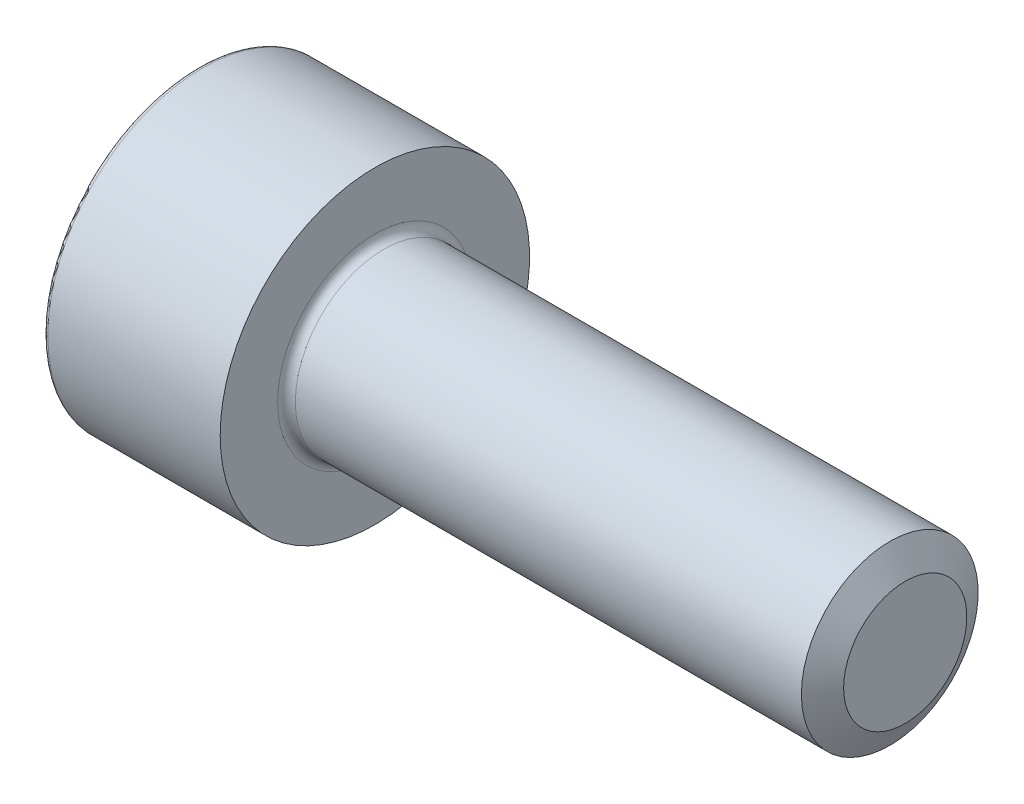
ISO-10303-21;
HEADER;
FILE_DESCRIPTION(('STEP AP214'),'2;1');
FILE_NAME('part.step','',(''),(''),'','','');
FILE_SCHEMA(('AUTOMOTIVE_DESIGN { 1 0 10303 214 1 1 1 1 }'));
ENDSEC;
DATA;
#1=APPLICATION_CONTEXT('core data for automotive mechanical design processes');
#2=APPLICATION_PROTOCOL_DEFINITION('international standard','automotive_design',2000,#1);
#3=PRODUCT_CONTEXT('',#1,'mechanical');
#4=PRODUCT('Part','Part','',(#3));
#5=PRODUCT_RELATED_PRODUCT_CATEGORY('part','',(#4));
#6=PRODUCT_DEFINITION_FORMATION('','',#4);
#7=PRODUCT_DEFINITION_CONTEXT('part definition',#1,'design');
#8=PRODUCT_DEFINITION('design','',#6,#7);
#9=PRODUCT_DEFINITION_SHAPE('','',#8);
#10=(LENGTH_UNIT() NAMED_UNIT(*) SI_UNIT(.MILLI.,.METRE.));
#11=(NAMED_UNIT(*) PLANE_ANGLE_UNIT() SI_UNIT($,.RADIAN.));
#12=(NAMED_UNIT(*) SI_UNIT($,.STERADIAN.) SOLID_ANGLE_UNIT());
#13=UNCERTAINTY_MEASURE_WITH_UNIT(LENGTH_MEASURE(1.E-05),#10,'distance_accuracy_value','');
#14=(GEOMETRIC_REPRESENTATION_CONTEXT(3) GLOBAL_UNCERTAINTY_ASSIGNED_CONTEXT((#13)) GLOBAL_UNIT_ASSIGNED_CONTEXT((#10,
#11,#12)) REPRESENTATION_CONTEXT('',''));
#15=CARTESIAN_POINT('',(0.,0.,0.));
#16=DIRECTION('',(0.,0.,1.));
#17=DIRECTION('',(1.,0.,0.));
#18=AXIS2_PLACEMENT_3D('',#15,#16,#17);
#19=CARTESIAN_POINT('',(0.,0.,0.));
#20=DIRECTION('',(-1.,0.,0.));
#21=DIRECTION('',(0.,0.,1.));
#22=AXIS2_PLACEMENT_3D('',#19,#20,#21);
#23=CYLINDRICAL_SURFACE('',#22,2.);
#24=CARTESIAN_POINT('',(4.2,0.,0.));
#25=DIRECTION('',(-1.,0.,0.));
#26=DIRECTION('',(0.,0.,1.));
#27=AXIS2_PLACEMENT_3D('',#24,#25,#26);
#28=CIRCLE('',#27,2.);
#29=CARTESIAN_POINT('',(4.2,0.,2.));
#30=VERTEX_POINT('',#29);
#31=EDGE_CURVE('E141',#30,#30,#28,.T.);
#32=ORIENTED_EDGE('',*,*,#31,.F.);
#33=EDGE_LOOP('',(#32));
#34=FACE_BOUND('',#33,.T.);
#35=CARTESIAN_POINT('',(15.6500102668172,0.,0.));
#36=DIRECTION('',(-1.,0.,0.));
#37=DIRECTION('',(0.,0.,1.));
#38=AXIS2_PLACEMENT_3D('',#35,#36,#37);
#39=CIRCLE('',#38,2.);
#40=CARTESIAN_POINT('',(15.6500102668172,0.,2.));
#41=VERTEX_POINT('',#40);
#42=EDGE_CURVE('E278',#41,#41,#39,.T.);
#43=ORIENTED_EDGE('',*,*,#42,.T.);
#44=EDGE_LOOP('',(#43));
#45=FACE_BOUND('',#44,.T.);
#46=ADVANCED_FACE('F38',(#34,#45),#23,.T.);
#47=CARTESIAN_POINT('',(0.,0.,0.));
#48=DIRECTION('',(1.,0.,0.));
#49=DIRECTION('',(0.,0.,-1.));
#50=AXIS2_PLACEMENT_3D('',#47,#48,#49);
#51=PLANE('',#50);
#52=CARTESIAN_POINT('',(0.,0.,0.));
#53=DIRECTION('',(1.,0.,0.));
#54=DIRECTION('',(0.,0.,-1.));
#55=AXIS2_PLACEMENT_3D('',#52,#53,#54);
#56=CIRCLE('',#55,3.4);
#57=CARTESIAN_POINT('',(0.,0.,-3.4));
#58=VERTEX_POINT('',#57);
#59=EDGE_CURVE('E46',#58,#58,#56,.F.);
#60=ORIENTED_EDGE('',*,*,#59,.T.);
#61=EDGE_LOOP('',(#60));
#62=FACE_BOUND('',#61,.T.);
#63=DIRECTION('',(0.,0.866025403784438,-0.5));
#64=VECTOR('',#63,1.);
#65=CARTESIAN_POINT('',(0.,0.,1.72));
#66=LINE('',#65,#64);
#67=CARTESIAN_POINT('',(0.,0.,1.72));
#68=VERTEX_POINT('',#67);
#69=CARTESIAN_POINT('',(0.,1.48956369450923,0.859999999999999));
#70=VERTEX_POINT('',#69);
#71=EDGE_CURVE('E127',#68,#70,#66,.T.);
#72=ORIENTED_EDGE('',*,*,#71,.F.);
#73=DIRECTION('',(0.,0.866025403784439,0.5));
#74=VECTOR('',#73,1.);
#75=CARTESIAN_POINT('',(0.,-1.48956369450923,0.86));
#76=LINE('',#75,#74);
#77=CARTESIAN_POINT('',(0.,-1.48956369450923,0.86));
#78=VERTEX_POINT('',#77);
#79=EDGE_CURVE('E53',#78,#68,#76,.T.);
#80=ORIENTED_EDGE('',*,*,#79,.F.);
#81=DIRECTION('',(0.,0.,1.));
#82=VECTOR('',#81,1.);
#83=CARTESIAN_POINT('',(0.,-1.48956369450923,-0.86));
#84=LINE('',#83,#82);
#85=CARTESIAN_POINT('',(0.,-1.48956369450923,-0.86));
#86=VERTEX_POINT('',#85);
#87=EDGE_CURVE('E137',#86,#78,#84,.T.);
#88=ORIENTED_EDGE('',*,*,#87,.F.);
#89=DIRECTION('',(0.,-0.866025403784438,0.5));
#90=VECTOR('',#89,1.);
#91=CARTESIAN_POINT('',(0.,0.,-1.72));
#92=LINE('',#91,#90);
#93=CARTESIAN_POINT('',(0.,0.,-1.72));
#94=VERTEX_POINT('',#93);
#95=EDGE_CURVE('E135',#94,#86,#92,.T.);
#96=ORIENTED_EDGE('',*,*,#95,.F.);
#97=DIRECTION('',(0.,-0.866025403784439,-0.5));
#98=VECTOR('',#97,1.);
#99=CARTESIAN_POINT('',(0.,1.48956369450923,-0.86));
#100=LINE('',#99,#98);
#101=CARTESIAN_POINT('',(0.,1.48956369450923,-0.86));
#102=VERTEX_POINT('',#101);
#103=EDGE_CURVE('E101',#102,#94,#100,.T.);
#104=ORIENTED_EDGE('',*,*,#103,.F.);
#105=DIRECTION('',(0.,0.,-1.));
#106=VECTOR('',#105,1.);
#107=CARTESIAN_POINT('',(0.,1.48956369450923,0.859999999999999));
#108=LINE('',#107,#106);
#109=EDGE_CURVE('E131',#70,#102,#108,.T.);
#110=ORIENTED_EDGE('',*,*,#109,.F.);
#111=EDGE_LOOP('',(#72,#80,#88,#96,#104,#110));
#112=FACE_BOUND('',#111,.T.);
#113=ADVANCED_FACE('F158',(#62,#112),#51,.F.);
#114=CARTESIAN_POINT('',(0.,0.,0.));
#115=DIRECTION('',(-1.,0.,0.));
#116=DIRECTION('',(0.,0.,1.));
#117=AXIS2_PLACEMENT_3D('',#114,#115,#116);
#118=CYLINDRICAL_SURFACE('',#117,3.5);
#119=CARTESIAN_POINT('',(0.1,0.,0.));
#120=DIRECTION('',(1.,0.,0.));
#121=DIRECTION('',(0.,0.,-1.));
#122=AXIS2_PLACEMENT_3D('',#119,#120,#121);
#123=CIRCLE('',#122,3.5);
#124=CARTESIAN_POINT('',(0.1,0.,-3.5));
#125=VERTEX_POINT('',#124);
#126=EDGE_CURVE('E11',#125,#125,#123,.T.);
#127=ORIENTED_EDGE('',*,*,#126,.T.);
#128=EDGE_LOOP('',(#127));
#129=FACE_BOUND('',#128,.T.);
#130=CARTESIAN_POINT('',(4.,0.,0.));
#131=DIRECTION('',(-1.,0.,0.));
#132=DIRECTION('',(0.,0.,1.));
#133=AXIS2_PLACEMENT_3D('',#130,#131,#132);
#134=CIRCLE('',#133,3.5);
#135=CARTESIAN_POINT('',(4.,0.,3.5));
#136=VERTEX_POINT('',#135);
#137=EDGE_CURVE('E152',#136,#136,#134,.T.);
#138=ORIENTED_EDGE('',*,*,#137,.T.);
#139=EDGE_LOOP('',(#138));
#140=FACE_BOUND('',#139,.T.);
#141=ADVANCED_FACE('F177',(#129,#140),#118,.T.);
#142=CARTESIAN_POINT('',(4.,3.5,0.));
#143=DIRECTION('',(-1.,0.,0.));
#144=DIRECTION('',(0.,0.,1.));
#145=AXIS2_PLACEMENT_3D('',#142,#143,#144);
#146=PLANE('',#145);
#147=ORIENTED_EDGE('',*,*,#137,.F.);
#148=EDGE_LOOP('',(#147));
#149=FACE_BOUND('',#148,.T.);
#150=CARTESIAN_POINT('',(4.,0.,0.));
#151=DIRECTION('',(-1.,0.,0.));
#152=DIRECTION('',(0.,0.,1.));
#153=AXIS2_PLACEMENT_3D('',#150,#151,#152);
#154=CIRCLE('',#153,2.2);
#155=CARTESIAN_POINT('',(4.,0.,2.2));
#156=VERTEX_POINT('',#155);
#157=EDGE_CURVE('E149',#156,#156,#154,.T.);
#158=ORIENTED_EDGE('',*,*,#157,.T.);
#159=EDGE_LOOP('',(#158));
#160=FACE_BOUND('',#159,.T.);
#161=ADVANCED_FACE('F186',(#149,#160),#146,.F.);
#162=CARTESIAN_POINT('',(4.2,0.,0.));
#163=DIRECTION('',(-1.,0.,0.));
#164=DIRECTION('',(0.,0.,1.));
#165=AXIS2_PLACEMENT_3D('',#162,#163,#164);
#166=TOROIDAL_SURFACE('',#165,2.2,0.2);
#167=ORIENTED_EDGE('',*,*,#157,.F.);
#168=EDGE_LOOP('',(#167));
#169=FACE_BOUND('',#168,.T.);
#170=ORIENTED_EDGE('',*,*,#31,.T.);
#171=EDGE_LOOP('',(#170));
#172=FACE_BOUND('',#171,.T.);
#173=ADVANCED_FACE('F182',(#169,#172),#166,.F.);
#174=CARTESIAN_POINT('',(2.,-1.48956369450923,0.86));
#175=DIRECTION('',(0.,-0.5,0.866025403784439));
#176=DIRECTION('',(0.,-0.866025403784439,-0.5));
#177=AXIS2_PLACEMENT_3D('',#174,#175,#176);
#178=PLANE('',#177);
#179=ORIENTED_EDGE('',*,*,#79,.T.);
#180=DIRECTION('',(-1.,0.,0.));
#181=VECTOR('',#180,1.);
#182=CARTESIAN_POINT('',(2.,0.,1.72));
#183=LINE('',#182,#181);
#184=CARTESIAN_POINT('',(2.,0.,1.72));
#185=VERTEX_POINT('',#184);
#186=EDGE_CURVE('E83',#185,#68,#183,.T.);
#187=ORIENTED_EDGE('',*,*,#186,.F.);
#188=DIRECTION('',(0.,0.866025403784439,0.5));
#189=VECTOR('',#188,1.);
#190=CARTESIAN_POINT('',(2.,-1.48956369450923,0.86));
#191=LINE('',#190,#189);
#192=CARTESIAN_POINT('',(2.,-1.48956369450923,0.86));
#193=VERTEX_POINT('',#192);
#194=EDGE_CURVE('E139',#193,#185,#191,.T.);
#195=ORIENTED_EDGE('',*,*,#194,.F.);
#196=DIRECTION('',(-1.,0.,0.));
#197=VECTOR('',#196,1.);
#198=CARTESIAN_POINT('',(2.,-1.48956369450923,0.86));
#199=LINE('',#198,#197);
#200=EDGE_CURVE('E61',#193,#78,#199,.T.);
#201=ORIENTED_EDGE('',*,*,#200,.T.);
#202=EDGE_LOOP('',(#179,#187,#195,#201));
#203=FACE_BOUND('',#202,.T.);
#204=ADVANCED_FACE('F185',(#203),#178,.F.);
#205=CARTESIAN_POINT('',(2.,-1.48956369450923,-0.86));
#206=DIRECTION('',(0.,-1.,0.));
#207=DIRECTION('',(0.,0.,-1.));
#208=AXIS2_PLACEMENT_3D('',#205,#206,#207);
#209=PLANE('',#208);
#210=ORIENTED_EDGE('',*,*,#87,.T.);
#211=ORIENTED_EDGE('',*,*,#200,.F.);
#212=DIRECTION('',(0.,0.,1.));
#213=VECTOR('',#212,1.);
#214=CARTESIAN_POINT('',(2.,-1.48956369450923,-0.86));
#215=LINE('',#214,#213);
#216=CARTESIAN_POINT('',(2.,-1.48956369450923,-0.86));
#217=VERTEX_POINT('',#216);
#218=EDGE_CURVE('E113',#217,#193,#215,.T.);
#219=ORIENTED_EDGE('',*,*,#218,.F.);
#220=DIRECTION('',(-1.,0.,0.));
#221=VECTOR('',#220,1.);
#222=CARTESIAN_POINT('',(2.,-1.48956369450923,-0.86));
#223=LINE('',#222,#221);
#224=EDGE_CURVE('E105',#217,#86,#223,.T.);
#225=ORIENTED_EDGE('',*,*,#224,.T.);
#226=EDGE_LOOP('',(#210,#211,#219,#225));
#227=FACE_BOUND('',#226,.T.);
#228=ADVANCED_FACE('F216',(#227),#209,.F.);
#229=CARTESIAN_POINT('',(2.,0.,-1.72));
#230=DIRECTION('',(0.,-0.5,-0.866025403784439));
#231=DIRECTION('',(0.,0.866025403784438,-0.5));
#232=AXIS2_PLACEMENT_3D('',#229,#230,#231);
#233=PLANE('',#232);
#234=ORIENTED_EDGE('',*,*,#95,.T.);
#235=ORIENTED_EDGE('',*,*,#224,.F.);
#236=DIRECTION('',(0.,-0.866025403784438,0.5));
#237=VECTOR('',#236,1.);
#238=CARTESIAN_POINT('',(2.,0.,-1.72));
#239=LINE('',#238,#237);
#240=CARTESIAN_POINT('',(2.,0.,-1.72));
#241=VERTEX_POINT('',#240);
#242=EDGE_CURVE('E109',#241,#217,#239,.T.);
#243=ORIENTED_EDGE('',*,*,#242,.F.);
#244=DIRECTION('',(-1.,0.,0.));
#245=VECTOR('',#244,1.);
#246=CARTESIAN_POINT('',(2.,0.,-1.72));
#247=LINE('',#246,#245);
#248=EDGE_CURVE('E94',#241,#94,#247,.T.);
#249=ORIENTED_EDGE('',*,*,#248,.T.);
#250=EDGE_LOOP('',(#234,#235,#243,#249));
#251=FACE_BOUND('',#250,.T.);
#252=ADVANCED_FACE('F110',(#251),#233,.F.);
#253=CARTESIAN_POINT('',(2.,1.48956369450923,-0.86));
#254=DIRECTION('',(0.,0.5,-0.866025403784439));
#255=DIRECTION('',(0.,0.866025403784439,0.5));
#256=AXIS2_PLACEMENT_3D('',#253,#254,#255);
#257=PLANE('',#256);
#258=ORIENTED_EDGE('',*,*,#103,.T.);
#259=ORIENTED_EDGE('',*,*,#248,.F.);
#260=DIRECTION('',(0.,-0.866025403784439,-0.5));
#261=VECTOR('',#260,1.);
#262=CARTESIAN_POINT('',(2.,1.48956369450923,-0.86));
#263=LINE('',#262,#261);
#264=CARTESIAN_POINT('',(2.,1.48956369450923,-0.86));
#265=VERTEX_POINT('',#264);
#266=EDGE_CURVE('E98',#265,#241,#263,.T.);
#267=ORIENTED_EDGE('',*,*,#266,.F.);
#268=DIRECTION('',(-1.,0.,0.));
#269=VECTOR('',#268,1.);
#270=CARTESIAN_POINT('',(2.,1.48956369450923,-0.86));
#271=LINE('',#270,#269);
#272=EDGE_CURVE('E106',#265,#102,#271,.T.);
#273=ORIENTED_EDGE('',*,*,#272,.T.);
#274=EDGE_LOOP('',(#258,#259,#267,#273));
#275=FACE_BOUND('',#274,.T.);
#276=ADVANCED_FACE('F96',(#275),#257,.F.);
#277=CARTESIAN_POINT('',(2.,1.48956369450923,0.859999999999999));
#278=DIRECTION('',(0.,1.,0.));
#279=DIRECTION('',(0.,0.,1.));
#280=AXIS2_PLACEMENT_3D('',#277,#278,#279);
#281=PLANE('',#280);
#282=ORIENTED_EDGE('',*,*,#109,.T.);
#283=ORIENTED_EDGE('',*,*,#272,.F.);
#284=DIRECTION('',(0.,0.,-1.));
#285=VECTOR('',#284,1.);
#286=CARTESIAN_POINT('',(2.,1.48956369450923,0.859999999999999));
#287=LINE('',#286,#285);
#288=CARTESIAN_POINT('',(2.,1.48956369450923,0.859999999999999));
#289=VERTEX_POINT('',#288);
#290=EDGE_CURVE('E119',#289,#265,#287,.T.);
#291=ORIENTED_EDGE('',*,*,#290,.F.);
#292=DIRECTION('',(-1.,0.,0.));
#293=VECTOR('',#292,1.);
#294=CARTESIAN_POINT('',(2.,1.48956369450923,0.859999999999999));
#295=LINE('',#294,#293);
#296=EDGE_CURVE('E144',#289,#70,#295,.T.);
#297=ORIENTED_EDGE('',*,*,#296,.T.);
#298=EDGE_LOOP('',(#282,#283,#291,#297));
#299=FACE_BOUND('',#298,.T.);
#300=ADVANCED_FACE('F234',(#299),#281,.F.);
#301=CARTESIAN_POINT('',(2.,0.,1.72));
#302=DIRECTION('',(0.,0.5,0.866025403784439));
#303=DIRECTION('',(0.,-0.866025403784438,0.5));
#304=AXIS2_PLACEMENT_3D('',#301,#302,#303);
#305=PLANE('',#304);
#306=ORIENTED_EDGE('',*,*,#71,.T.);
#307=ORIENTED_EDGE('',*,*,#296,.F.);
#308=DIRECTION('',(0.,0.866025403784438,-0.5));
#309=VECTOR('',#308,1.);
#310=CARTESIAN_POINT('',(2.,0.,1.72));
#311=LINE('',#310,#309);
#312=EDGE_CURVE('E121',#185,#289,#311,.T.);
#313=ORIENTED_EDGE('',*,*,#312,.F.);
#314=ORIENTED_EDGE('',*,*,#186,.T.);
#315=EDGE_LOOP('',(#306,#307,#313,#314));
#316=FACE_BOUND('',#315,.T.);
#317=ADVANCED_FACE('F241',(#316),#305,.F.);
#318=CARTESIAN_POINT('',(2.,1.48956369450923,2.58));
#319=DIRECTION('',(-1.,0.,0.));
#320=DIRECTION('',(0.,0.,1.));
#321=AXIS2_PLACEMENT_3D('',#318,#319,#320);
#322=PLANE('',#321);
#323=ORIENTED_EDGE('',*,*,#194,.T.);
#324=ORIENTED_EDGE('',*,*,#312,.T.);
#325=ORIENTED_EDGE('',*,*,#290,.T.);
#326=ORIENTED_EDGE('',*,*,#266,.T.);
#327=ORIENTED_EDGE('',*,*,#242,.T.);
#328=ORIENTED_EDGE('',*,*,#218,.T.);
#329=EDGE_LOOP('',(#323,#324,#325,#326,#327,#328));
#330=FACE_BOUND('',#329,.T.);
#331=ADVANCED_FACE('F116',(#330),#322,.T.);
#332=CARTESIAN_POINT('',(15.6500102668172,0.,0.));
#333=DIRECTION('',(-1.,0.,0.));
#334=DIRECTION('',(0.,0.,1.));
#335=AXIS2_PLACEMENT_3D('',#332,#333,#334);
#336=CONICAL_SURFACE('',#335,2.,1.04719755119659);
#337=CARTESIAN_POINT('',(16.,0.,0.));
#338=DIRECTION('',(-1.,0.,0.));
#339=DIRECTION('',(0.,0.,1.));
#340=AXIS2_PLACEMENT_3D('',#337,#338,#339);
#341=CIRCLE('',#340,1.3938);
#342=CARTESIAN_POINT('',(16.,0.,1.3938));
#343=VERTEX_POINT('',#342);
#344=EDGE_CURVE('E128',#343,#343,#341,.T.);
#345=ORIENTED_EDGE('',*,*,#344,.T.);
#346=EDGE_LOOP('',(#345));
#347=FACE_BOUND('',#346,.T.);
#348=ORIENTED_EDGE('',*,*,#42,.F.);
#349=EDGE_LOOP('',(#348));
#350=FACE_BOUND('',#349,.T.);
#351=ADVANCED_FACE('F167',(#347,#350),#336,.T.);
#352=CARTESIAN_POINT('',(16.,2.,0.));
#353=DIRECTION('',(-1.,0.,0.));
#354=DIRECTION('',(0.,0.,1.));
#355=AXIS2_PLACEMENT_3D('',#352,#353,#354);
#356=PLANE('',#355);
#357=ORIENTED_EDGE('',*,*,#344,.F.);
#358=EDGE_LOOP('',(#357));
#359=FACE_BOUND('',#358,.T.);
#360=ADVANCED_FACE('F162',(#359),#356,.F.);
#361=CARTESIAN_POINT('',(0.1,0.,0.));
#362=DIRECTION('',(1.,0.,0.));
#363=DIRECTION('',(0.,0.,-1.));
#364=AXIS2_PLACEMENT_3D('',#361,#362,#363);
#365=TOROIDAL_SURFACE('',#364,3.4,0.1);
#366=ORIENTED_EDGE('',*,*,#126,.F.);
#367=EDGE_LOOP('',(#366));
#368=FACE_BOUND('',#367,.T.);
#369=ORIENTED_EDGE('',*,*,#59,.F.);
#370=EDGE_LOOP('',(#369));
#371=FACE_BOUND('',#370,.T.);
#372=ADVANCED_FACE('F40',(#368,#371),#365,.T.);
#373=CLOSED_SHELL('',(#46,#113,#141,#161,#173,#204,#228,#252,#276,#300,#317,#331,#351,#360,#372));
#374=MANIFOLD_SOLID_BREP('B2',#373);
#375=ADVANCED_BREP_SHAPE_REPRESENTATION('',(#18,#374),#14);
#376=SHAPE_DEFINITION_REPRESENTATION(#9,#375);
ENDSEC;
END-ISO-10303-21;
